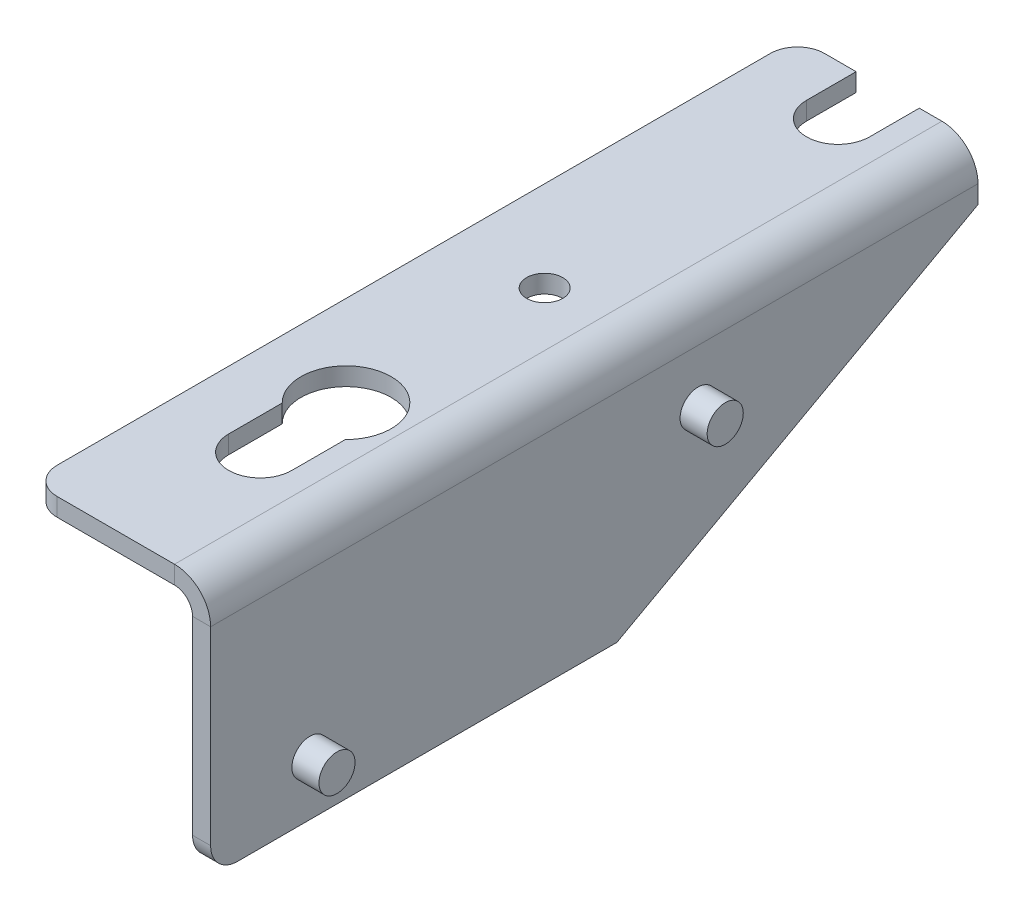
ISO-10303-21;
HEADER;
FILE_DESCRIPTION(('STEP AP214'),'2;1');
FILE_NAME('part.step','',(''),(''),'','','');
FILE_SCHEMA(('AUTOMOTIVE_DESIGN { 1 0 10303 214 1 1 1 1 }'));
ENDSEC;
DATA;
#1=APPLICATION_CONTEXT('core data for automotive mechanical design processes');
#2=APPLICATION_PROTOCOL_DEFINITION('international standard','automotive_design',2000,#1);
#3=PRODUCT_CONTEXT('',#1,'mechanical');
#4=PRODUCT('Part','Part','',(#3));
#5=PRODUCT_RELATED_PRODUCT_CATEGORY('part','',(#4));
#6=PRODUCT_DEFINITION_FORMATION('','',#4);
#7=PRODUCT_DEFINITION_CONTEXT('part definition',#1,'design');
#8=PRODUCT_DEFINITION('design','',#6,#7);
#9=PRODUCT_DEFINITION_SHAPE('','',#8);
#10=(LENGTH_UNIT() NAMED_UNIT(*) SI_UNIT(.MILLI.,.METRE.));
#11=(NAMED_UNIT(*) PLANE_ANGLE_UNIT() SI_UNIT($,.RADIAN.));
#12=(NAMED_UNIT(*) SI_UNIT($,.STERADIAN.) SOLID_ANGLE_UNIT());
#13=UNCERTAINTY_MEASURE_WITH_UNIT(LENGTH_MEASURE(1.E-05),#10,'distance_accuracy_value','');
#14=(GEOMETRIC_REPRESENTATION_CONTEXT(3) GLOBAL_UNCERTAINTY_ASSIGNED_CONTEXT((#13)) GLOBAL_UNIT_ASSIGNED_CONTEXT((#10,
#11,#12)) REPRESENTATION_CONTEXT('',''));
#15=CARTESIAN_POINT('',(0.,0.,0.));
#16=DIRECTION('',(0.,0.,1.));
#17=DIRECTION('',(1.,0.,0.));
#18=AXIS2_PLACEMENT_3D('',#15,#16,#17);
#19=CARTESIAN_POINT('',(0.,0.,85.0000000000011));
#20=DIRECTION('',(-1.,0.,0.));
#21=DIRECTION('',(0.,0.,1.));
#22=AXIS2_PLACEMENT_3D('',#19,#20,#21);
#23=PLANE('',#22);
#24=CARTESIAN_POINT('',(-1.55431223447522E-12,6.00000000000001,74.0000000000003));
#25=DIRECTION('',(-1.,0.,0.));
#26=DIRECTION('',(0.,0.,1.));
#27=AXIS2_PLACEMENT_3D('',#24,#25,#26);
#28=CIRCLE('',#27,2.);
#29=CARTESIAN_POINT('',(-1.55431223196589E-12,6.00000000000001,76.0000000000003));
#30=VERTEX_POINT('',#29);
#31=EDGE_CURVE('E56',#30,#30,#28,.F.);
#32=ORIENTED_EDGE('',*,*,#31,.F.);
#33=EDGE_LOOP('',(#32));
#34=FACE_BOUND('',#33,.T.);
#35=DIRECTION('',(0.,1.,0.));
#36=VECTOR('',#35,1.);
#37=CARTESIAN_POINT('',(0.,0.,85.0000000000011));
#38=LINE('',#37,#36);
#39=CARTESIAN_POINT('',(-1.55431223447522E-12,3.,84.9999999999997));
#40=VERTEX_POINT('',#39);
#41=CARTESIAN_POINT('',(0.,24.,84.9999999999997));
#42=VERTEX_POINT('',#41);
#43=EDGE_CURVE('E299',#40,#42,#38,.T.);
#44=ORIENTED_EDGE('',*,*,#43,.F.);
#45=CARTESIAN_POINT('',(-1.55431223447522E-12,3.00000000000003,81.9999999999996));
#46=DIRECTION('',(-1.,0.,0.));
#47=DIRECTION('',(0.,0.,1.));
#48=AXIS2_PLACEMENT_3D('',#45,#46,#47);
#49=CIRCLE('',#48,3.);
#50=CARTESIAN_POINT('',(0.,0.,82.0000000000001));
#51=VERTEX_POINT('',#50);
#52=EDGE_CURVE('E357',#40,#51,#49,.F.);
#53=ORIENTED_EDGE('',*,*,#52,.T.);
#54=DIRECTION('',(0.,0.,-1.));
#55=VECTOR('',#54,1.);
#56=CARTESIAN_POINT('',(0.,0.,85.0000000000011));
#57=LINE('',#56,#55);
#58=CARTESIAN_POINT('',(0.,0.,39.9999999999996));
#59=VERTEX_POINT('',#58);
#60=EDGE_CURVE('E310',#51,#59,#57,.T.);
#61=ORIENTED_EDGE('',*,*,#60,.T.);
#62=DIRECTION('',(0.,-0.481918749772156,0.876215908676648));
#63=VECTOR('',#62,1.);
#64=CARTESIAN_POINT('',(-1.55431223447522E-12,22.,-4.44089209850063E-13));
#65=LINE('',#64,#63);
#66=CARTESIAN_POINT('',(-1.55431223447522E-12,22.,-4.44089209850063E-13));
#67=VERTEX_POINT('',#66);
#68=EDGE_CURVE('E262',#67,#59,#65,.T.);
#69=ORIENTED_EDGE('',*,*,#68,.F.);
#70=DIRECTION('',(0.,1.,0.));
#71=VECTOR('',#70,1.);
#72=CARTESIAN_POINT('',(0.,0.,0.));
#73=LINE('',#72,#71);
#74=CARTESIAN_POINT('',(-1.55431223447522E-12,24.,0.));
#75=VERTEX_POINT('',#74);
#76=EDGE_CURVE('E283',#67,#75,#73,.T.);
#77=ORIENTED_EDGE('',*,*,#76,.T.);
#78=DIRECTION('',(0.,0.,-1.));
#79=VECTOR('',#78,1.);
#80=CARTESIAN_POINT('',(0.,24.,84.9999999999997));
#81=LINE('',#80,#79);
#82=EDGE_CURVE('E307',#42,#75,#81,.T.);
#83=ORIENTED_EDGE('',*,*,#82,.F.);
#84=EDGE_LOOP('',(#44,#53,#61,#69,#77,#83));
#85=FACE_BOUND('',#84,.T.);
#86=CARTESIAN_POINT('',(-1.55431223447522E-12,18.,30.9999999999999));
#87=DIRECTION('',(-1.,0.,0.));
#88=DIRECTION('',(0.,0.,1.));
#89=AXIS2_PLACEMENT_3D('',#86,#87,#88);
#90=CIRCLE('',#89,2.);
#91=CARTESIAN_POINT('',(-1.55431223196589E-12,18.,32.9999999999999));
#92=VERTEX_POINT('',#91);
#93=EDGE_CURVE('E11',#92,#92,#90,.F.);
#94=ORIENTED_EDGE('',*,*,#93,.F.);
#95=EDGE_LOOP('',(#94));
#96=FACE_BOUND('',#95,.T.);
#97=ADVANCED_FACE('F48',(#34,#85,#96),#23,.F.);
#98=CARTESIAN_POINT('',(-2.00000000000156,24.,0.));
#99=DIRECTION('',(0.,0.,-1.));
#100=DIRECTION('',(-1.,0.,0.));
#101=AXIS2_PLACEMENT_3D('',#98,#99,#100);
#102=PLANE('',#101);
#103=DIRECTION('',(0.,1.,0.));
#104=VECTOR('',#103,1.);
#105=CARTESIAN_POINT('',(-6.49999999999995,-0.00100000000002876,0.));
#106=LINE('',#105,#104);
#107=CARTESIAN_POINT('',(-6.5000000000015,26.,-1.55431223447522E-12));
#108=VERTEX_POINT('',#107);
#109=CARTESIAN_POINT('',(-6.5000000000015,28.,8.88178419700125E-13));
#110=VERTEX_POINT('',#109);
#111=EDGE_CURVE('E242',#108,#110,#106,.T.);
#112=ORIENTED_EDGE('',*,*,#111,.T.);
#113=DIRECTION('',(-1.,0.,0.));
#114=VECTOR('',#113,1.);
#115=CARTESIAN_POINT('',(-1.55431223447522E-12,28.,8.88178419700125E-13));
#116=LINE('',#115,#114);
#117=CARTESIAN_POINT('',(-4.00000000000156,28.,8.88178419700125E-13));
#118=VERTEX_POINT('',#117);
#119=EDGE_CURVE('E271',#118,#110,#116,.T.);
#120=ORIENTED_EDGE('',*,*,#119,.F.);
#121=DIRECTION('',(0.,-1.,0.));
#122=VECTOR('',#121,1.);
#123=CARTESIAN_POINT('',(-4.00000000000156,28.,8.88178419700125E-13));
#124=LINE('',#123,#122);
#125=CARTESIAN_POINT('',(-4.00000000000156,26.,-1.55431223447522E-12));
#126=VERTEX_POINT('',#125);
#127=EDGE_CURVE('E329',#118,#126,#124,.T.);
#128=ORIENTED_EDGE('',*,*,#127,.T.);
#129=DIRECTION('',(-1.,0.,0.));
#130=VECTOR('',#129,1.);
#131=CARTESIAN_POINT('',(-1.55431223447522E-12,26.,-1.55431223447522E-12));
#132=LINE('',#131,#130);
#133=EDGE_CURVE('E275',#126,#108,#132,.T.);
#134=ORIENTED_EDGE('',*,*,#133,.T.);
#135=EDGE_LOOP('',(#112,#120,#128,#134));
#136=FACE_BOUND('',#135,.T.);
#137=ADVANCED_FACE('F367',(#136),#102,.T.);
#138=CARTESIAN_POINT('',(-2.,0.,85.0000000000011));
#139=DIRECTION('',(-1.,0.,0.));
#140=DIRECTION('',(0.,0.,1.));
#141=AXIS2_PLACEMENT_3D('',#138,#139,#140);
#142=PLANE('',#141);
#143=DIRECTION('',(0.,0.,-1.));
#144=VECTOR('',#143,1.);
#145=CARTESIAN_POINT('',(-2.,0.,85.0000000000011));
#146=LINE('',#145,#144);
#147=CARTESIAN_POINT('',(-2.,0.,82.0000000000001));
#148=VERTEX_POINT('',#147);
#149=CARTESIAN_POINT('',(-2.,0.,39.9999999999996));
#150=VERTEX_POINT('',#149);
#151=EDGE_CURVE('E312',#148,#150,#146,.T.);
#152=ORIENTED_EDGE('',*,*,#151,.F.);
#153=CARTESIAN_POINT('',(-2.00000000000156,3.00000000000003,81.9999999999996));
#154=DIRECTION('',(-1.,0.,0.));
#155=DIRECTION('',(0.,0.,1.));
#156=AXIS2_PLACEMENT_3D('',#153,#154,#155);
#157=CIRCLE('',#156,3.);
#158=CARTESIAN_POINT('',(-2.00000000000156,3.,84.9999999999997));
#159=VERTEX_POINT('',#158);
#160=EDGE_CURVE('E71',#148,#159,#157,.T.);
#161=ORIENTED_EDGE('',*,*,#160,.T.);
#162=DIRECTION('',(0.,1.,0.));
#163=VECTOR('',#162,1.);
#164=CARTESIAN_POINT('',(-2.,0.,85.0000000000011));
#165=LINE('',#164,#163);
#166=CARTESIAN_POINT('',(-2.,24.,84.9999999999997));
#167=VERTEX_POINT('',#166);
#168=EDGE_CURVE('E297',#159,#167,#165,.T.);
#169=ORIENTED_EDGE('',*,*,#168,.T.);
#170=DIRECTION('',(0.,0.,-1.));
#171=VECTOR('',#170,1.);
#172=CARTESIAN_POINT('',(-2.,24.,84.9999999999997));
#173=LINE('',#172,#171);
#174=CARTESIAN_POINT('',(-2.00000000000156,24.,0.));
#175=VERTEX_POINT('',#174);
#176=EDGE_CURVE('E314',#167,#175,#173,.T.);
#177=ORIENTED_EDGE('',*,*,#176,.T.);
#178=DIRECTION('',(0.,1.,0.));
#179=VECTOR('',#178,1.);
#180=CARTESIAN_POINT('',(-2.,0.,0.));
#181=LINE('',#180,#179);
#182=CARTESIAN_POINT('',(-2.00000000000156,22.,-4.44089209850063E-13));
#183=VERTEX_POINT('',#182);
#184=EDGE_CURVE('E281',#183,#175,#181,.T.);
#185=ORIENTED_EDGE('',*,*,#184,.F.);
#186=DIRECTION('',(0.,-0.481918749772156,0.876215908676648));
#187=VECTOR('',#186,1.);
#188=CARTESIAN_POINT('',(-2.00000000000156,22.,-4.44089209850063E-13));
#189=LINE('',#188,#187);
#190=EDGE_CURVE('E257',#183,#150,#189,.T.);
#191=ORIENTED_EDGE('',*,*,#190,.T.);
#192=EDGE_LOOP('',(#152,#161,#169,#177,#185,#191));
#193=FACE_BOUND('',#192,.T.);
#194=ADVANCED_FACE('F453',(#193),#142,.T.);
#195=CARTESIAN_POINT('',(0.,0.,85.0000000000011));
#196=DIRECTION('',(0.,-1.,0.));
#197=DIRECTION('',(0.,0.,-1.));
#198=AXIS2_PLACEMENT_3D('',#195,#196,#197);
#199=PLANE('',#198);
#200=ORIENTED_EDGE('',*,*,#60,.F.);
#201=DIRECTION('',(-1.,0.,0.));
#202=VECTOR('',#201,1.);
#203=CARTESIAN_POINT('',(0.,0.,82.0000000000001));
#204=LINE('',#203,#202);
#205=EDGE_CURVE('E352',#51,#148,#204,.T.);
#206=ORIENTED_EDGE('',*,*,#205,.T.);
#207=ORIENTED_EDGE('',*,*,#151,.T.);
#208=DIRECTION('',(-1.,0.,0.));
#209=VECTOR('',#208,1.);
#210=CARTESIAN_POINT('',(-2.,0.,39.9999999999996));
#211=LINE('',#210,#209);
#212=EDGE_CURVE('E265',#150,#59,#211,.F.);
#213=ORIENTED_EDGE('',*,*,#212,.T.);
#214=EDGE_LOOP('',(#200,#206,#207,#213));
#215=FACE_BOUND('',#214,.T.);
#216=ADVANCED_FACE('F441',(#215),#199,.T.);
#217=CARTESIAN_POINT('',(-4.00000000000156,24.,0.));
#218=DIRECTION('',(0.,0.,1.));
#219=DIRECTION('',(1.,0.,0.));
#220=AXIS2_PLACEMENT_3D('',#217,#218,#219);
#221=PLANE('',#220);
#222=DIRECTION('',(-1.,0.,0.));
#223=VECTOR('',#222,1.);
#224=CARTESIAN_POINT('',(-2.00000000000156,22.,-4.44089209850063E-13));
#225=LINE('',#224,#223);
#226=EDGE_CURVE('E266',#183,#67,#225,.F.);
#227=ORIENTED_EDGE('',*,*,#226,.F.);
#228=ORIENTED_EDGE('',*,*,#184,.T.);
#229=DIRECTION('',(1.,0.,0.));
#230=VECTOR('',#229,1.);
#231=CARTESIAN_POINT('',(-2.00000000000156,24.,0.));
#232=LINE('',#231,#230);
#233=EDGE_CURVE('E326',#175,#75,#232,.T.);
#234=ORIENTED_EDGE('',*,*,#233,.T.);
#235=ORIENTED_EDGE('',*,*,#76,.F.);
#236=EDGE_LOOP('',(#227,#228,#234,#235));
#237=FACE_BOUND('',#236,.T.);
#238=ADVANCED_FACE('F438',(#237),#221,.F.);
#239=CARTESIAN_POINT('',(0.,24.,84.9999999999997));
#240=DIRECTION('',(0.,0.,1.));
#241=DIRECTION('',(1.,0.,0.));
#242=AXIS2_PLACEMENT_3D('',#239,#240,#241);
#243=PLANE('',#242);
#244=DIRECTION('',(-1.,0.,0.));
#245=VECTOR('',#244,1.);
#246=CARTESIAN_POINT('',(0.,24.,84.9999999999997));
#247=LINE('',#246,#245);
#248=EDGE_CURVE('E333',#42,#167,#247,.T.);
#249=ORIENTED_EDGE('',*,*,#248,.F.);
#250=CARTESIAN_POINT('',(-4.,24.,84.9999999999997));
#251=DIRECTION('',(0.,0.,-1.));
#252=DIRECTION('',(-1.,0.,0.));
#253=AXIS2_PLACEMENT_3D('',#250,#251,#252);
#254=CIRCLE('',#253,4.);
#255=CARTESIAN_POINT('',(-4.,28.0000000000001,84.9999999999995));
#256=VERTEX_POINT('',#255);
#257=EDGE_CURVE('E301',#42,#256,#254,.F.);
#258=ORIENTED_EDGE('',*,*,#257,.T.);
#259=DIRECTION('',(0.,1.,0.));
#260=VECTOR('',#259,1.);
#261=CARTESIAN_POINT('',(-4.,26.,85.));
#262=LINE('',#261,#260);
#263=CARTESIAN_POINT('',(-4.,26.,85.));
#264=VERTEX_POINT('',#263);
#265=EDGE_CURVE('E331',#264,#256,#262,.T.);
#266=ORIENTED_EDGE('',*,*,#265,.F.);
#267=CARTESIAN_POINT('',(-4.,24.,84.9999999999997));
#268=DIRECTION('',(0.,0.,1.));
#269=DIRECTION('',(1.,0.,0.));
#270=AXIS2_PLACEMENT_3D('',#267,#268,#269);
#271=CIRCLE('',#270,2.);
#272=EDGE_CURVE('E294',#167,#264,#271,.T.);
#273=ORIENTED_EDGE('',*,*,#272,.F.);
#274=EDGE_LOOP('',(#249,#258,#266,#273));
#275=FACE_BOUND('',#274,.T.);
#276=ADVANCED_FACE('F50',(#275),#243,.T.);
#277=CARTESIAN_POINT('',(-4.,26.,85.));
#278=DIRECTION('',(0.,0.,1.));
#279=DIRECTION('',(1.,0.,0.));
#280=AXIS2_PLACEMENT_3D('',#277,#278,#279);
#281=PLANE('',#280);
#282=ORIENTED_EDGE('',*,*,#168,.F.);
#283=DIRECTION('',(-1.,0.,0.));
#284=VECTOR('',#283,1.);
#285=CARTESIAN_POINT('',(-4.00000000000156,3.,84.9999999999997));
#286=LINE('',#285,#284);
#287=EDGE_CURVE('E63',#159,#40,#286,.F.);
#288=ORIENTED_EDGE('',*,*,#287,.T.);
#289=ORIENTED_EDGE('',*,*,#43,.T.);
#290=ORIENTED_EDGE('',*,*,#248,.T.);
#291=EDGE_LOOP('',(#282,#288,#289,#290));
#292=FACE_BOUND('',#291,.T.);
#293=ADVANCED_FACE('F476',(#292),#281,.T.);
#294=CARTESIAN_POINT('',(-4.00000000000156,28.,8.88178419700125E-13));
#295=DIRECTION('',(0.,0.,-1.));
#296=DIRECTION('',(-1.,0.,0.));
#297=AXIS2_PLACEMENT_3D('',#294,#295,#296);
#298=PLANE('',#297);
#299=ORIENTED_EDGE('',*,*,#127,.F.);
#300=CARTESIAN_POINT('',(-4.00000000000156,24.,0.));
#301=DIRECTION('',(0.,0.,-1.));
#302=DIRECTION('',(-1.,0.,0.));
#303=AXIS2_PLACEMENT_3D('',#300,#301,#302);
#304=CIRCLE('',#303,4.);
#305=EDGE_CURVE('E285',#75,#118,#304,.F.);
#306=ORIENTED_EDGE('',*,*,#305,.F.);
#307=ORIENTED_EDGE('',*,*,#233,.F.);
#308=CARTESIAN_POINT('',(-4.00000000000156,24.,0.));
#309=DIRECTION('',(0.,0.,1.));
#310=DIRECTION('',(1.,0.,0.));
#311=AXIS2_PLACEMENT_3D('',#308,#309,#310);
#312=CIRCLE('',#311,2.);
#313=EDGE_CURVE('E278',#175,#126,#312,.T.);
#314=ORIENTED_EDGE('',*,*,#313,.T.);
#315=EDGE_LOOP('',(#299,#306,#307,#314));
#316=FACE_BOUND('',#315,.T.);
#317=ADVANCED_FACE('F473',(#316),#298,.T.);
#318=CARTESIAN_POINT('',(-13.5000000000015,26.,0.));
#319=VERTEX_POINT('',#318);
#320=CARTESIAN_POINT('',(-17.0000000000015,26.,0.));
#321=VERTEX_POINT('',#320);
#322=EDGE_CURVE('E274',#319,#321,#132,.T.);
#323=ORIENTED_EDGE('',*,*,#322,.T.);
#324=DIRECTION('',(0.,1.,0.));
#325=VECTOR('',#324,1.);
#326=CARTESIAN_POINT('',(-17.0000000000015,24.,0.));
#327=LINE('',#326,#325);
#328=CARTESIAN_POINT('',(-17.0000000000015,28.,8.88178419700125E-13));
#329=VERTEX_POINT('',#328);
#330=EDGE_CURVE('E336',#321,#329,#327,.T.);
#331=ORIENTED_EDGE('',*,*,#330,.T.);
#332=CARTESIAN_POINT('',(-13.5000000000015,28.,8.88178419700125E-13));
#333=VERTEX_POINT('',#332);
#334=EDGE_CURVE('E268',#333,#329,#116,.T.);
#335=ORIENTED_EDGE('',*,*,#334,.F.);
#336=DIRECTION('',(0.,1.,0.));
#337=VECTOR('',#336,1.);
#338=CARTESIAN_POINT('',(-13.5,-0.00100000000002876,0.));
#339=LINE('',#338,#337);
#340=EDGE_CURVE('E241',#319,#333,#339,.T.);
#341=ORIENTED_EDGE('',*,*,#340,.F.);
#342=EDGE_LOOP('',(#323,#331,#335,#341));
#343=FACE_BOUND('',#342,.T.);
#344=ADVANCED_FACE('F469',(#343),#102,.T.);
#345=CARTESIAN_POINT('',(0.,28.0000000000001,84.9999999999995));
#346=DIRECTION('',(0.,-1.,0.));
#347=DIRECTION('',(1.,0.,0.));
#348=AXIS2_PLACEMENT_3D('',#345,#346,#347);
#349=PLANE('',#348);
#350=DIRECTION('',(0.,0.,-1.));
#351=VECTOR('',#350,1.);
#352=CARTESIAN_POINT('',(-6.50000000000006,28.,69.5000000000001));
#353=LINE('',#352,#351);
#354=CARTESIAN_POINT('',(-6.50000000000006,28.,69.5000000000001));
#355=VERTEX_POINT('',#354);
#356=CARTESIAN_POINT('',(-6.50000000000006,27.9999999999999,63.5707142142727));
#357=VERTEX_POINT('',#356);
#358=EDGE_CURVE('E212',#355,#357,#353,.T.);
#359=ORIENTED_EDGE('',*,*,#358,.F.);
#360=CARTESIAN_POINT('',(-10.,28.,69.4999999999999));
#361=DIRECTION('',(0.,1.,0.));
#362=DIRECTION('',(-1.,0.,0.));
#363=AXIS2_PLACEMENT_3D('',#360,#361,#362);
#364=CIRCLE('',#363,3.5);
#365=CARTESIAN_POINT('',(-13.5000000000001,28.,69.5000000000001));
#366=VERTEX_POINT('',#365);
#367=EDGE_CURVE('E204',#366,#355,#364,.T.);
#368=ORIENTED_EDGE('',*,*,#367,.F.);
#369=DIRECTION('',(0.,0.,1.));
#370=VECTOR('',#369,1.);
#371=CARTESIAN_POINT('',(-13.5000000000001,28.,69.5000000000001));
#372=LINE('',#371,#370);
#373=CARTESIAN_POINT('',(-13.5000000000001,28.,63.5707142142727));
#374=VERTEX_POINT('',#373);
#375=EDGE_CURVE('E205',#374,#366,#372,.T.);
#376=ORIENTED_EDGE('',*,*,#375,.F.);
#377=CARTESIAN_POINT('',(-10.,28.,60.0000000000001));
#378=DIRECTION('',(0.,1.,0.));
#379=DIRECTION('',(-1.,0.,0.));
#380=AXIS2_PLACEMENT_3D('',#377,#378,#379);
#381=CIRCLE('',#380,5.00000000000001);
#382=EDGE_CURVE('E219',#357,#374,#381,.T.);
#383=ORIENTED_EDGE('',*,*,#382,.F.);
#384=EDGE_LOOP('',(#359,#368,#376,#383));
#385=FACE_BOUND('',#384,.T.);
#386=CARTESIAN_POINT('',(-10.,27.9999999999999,38.0000000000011));
#387=DIRECTION('',(0.,1.,0.));
#388=DIRECTION('',(-1.,0.,0.));
#389=AXIS2_PLACEMENT_3D('',#386,#387,#388);
#390=CIRCLE('',#389,2.);
#391=CARTESIAN_POINT('',(-12.,27.9999999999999,38.0000000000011));
#392=VERTEX_POINT('',#391);
#393=EDGE_CURVE('E254',#392,#392,#390,.T.);
#394=ORIENTED_EDGE('',*,*,#393,.F.);
#395=EDGE_LOOP('',(#394));
#396=FACE_BOUND('',#395,.T.);
#397=ORIENTED_EDGE('',*,*,#334,.T.);
#398=CARTESIAN_POINT('',(-17.0000000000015,28.,3.00000000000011));
#399=DIRECTION('',(0.,-1.,0.));
#400=DIRECTION('',(1.,0.,0.));
#401=AXIS2_PLACEMENT_3D('',#398,#399,#400);
#402=CIRCLE('',#401,3.);
#403=CARTESIAN_POINT('',(-20.0000000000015,27.9999999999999,3.00000000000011));
#404=VERTEX_POINT('',#403);
#405=EDGE_CURVE('E341',#329,#404,#402,.F.);
#406=ORIENTED_EDGE('',*,*,#405,.T.);
#407=DIRECTION('',(0.,0.,-1.));
#408=VECTOR('',#407,1.);
#409=CARTESIAN_POINT('',(-20.,28.,84.9999999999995));
#410=LINE('',#409,#408);
#411=CARTESIAN_POINT('',(-20.,28.,82.0000000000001));
#412=VERTEX_POINT('',#411);
#413=EDGE_CURVE('E323',#412,#404,#410,.T.);
#414=ORIENTED_EDGE('',*,*,#413,.F.);
#415=CARTESIAN_POINT('',(-17.,28.,82.0000000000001));
#416=DIRECTION('',(0.,-1.,0.));
#417=DIRECTION('',(1.,0.,0.));
#418=AXIS2_PLACEMENT_3D('',#415,#416,#417);
#419=CIRCLE('',#418,3.);
#420=CARTESIAN_POINT('',(-17.,28.0000000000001,84.9999999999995));
#421=VERTEX_POINT('',#420);
#422=EDGE_CURVE('E339',#412,#421,#419,.F.);
#423=ORIENTED_EDGE('',*,*,#422,.T.);
#424=DIRECTION('',(-1.,0.,0.));
#425=VECTOR('',#424,1.);
#426=CARTESIAN_POINT('',(0.,28.0000000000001,84.9999999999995));
#427=LINE('',#426,#425);
#428=EDGE_CURVE('E288',#256,#421,#427,.T.);
#429=ORIENTED_EDGE('',*,*,#428,.F.);
#430=DIRECTION('',(0.,0.,-1.));
#431=VECTOR('',#430,1.);
#432=CARTESIAN_POINT('',(-4.,28.0000000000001,84.9999999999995));
#433=LINE('',#432,#431);
#434=EDGE_CURVE('E304',#256,#118,#433,.T.);
#435=ORIENTED_EDGE('',*,*,#434,.T.);
#436=ORIENTED_EDGE('',*,*,#119,.T.);
#437=DIRECTION('',(0.,0.,-1.));
#438=VECTOR('',#437,1.);
#439=CARTESIAN_POINT('',(-6.5000000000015,27.9999999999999,5.50000000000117));
#440=LINE('',#439,#438);
#441=CARTESIAN_POINT('',(-6.5000000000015,27.9999999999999,5.50000000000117));
#442=VERTEX_POINT('',#441);
#443=EDGE_CURVE('E239',#442,#110,#440,.T.);
#444=ORIENTED_EDGE('',*,*,#443,.F.);
#445=CARTESIAN_POINT('',(-10.0000000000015,28.,5.50000000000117));
#446=DIRECTION('',(0.,1.,0.));
#447=DIRECTION('',(-1.,0.,0.));
#448=AXIS2_PLACEMENT_3D('',#445,#446,#447);
#449=CIRCLE('',#448,3.5);
#450=CARTESIAN_POINT('',(-13.5000000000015,28.,5.50000000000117));
#451=VERTEX_POINT('',#450);
#452=EDGE_CURVE('E236',#451,#442,#449,.T.);
#453=ORIENTED_EDGE('',*,*,#452,.F.);
#454=DIRECTION('',(0.,0.,1.));
#455=VECTOR('',#454,1.);
#456=CARTESIAN_POINT('',(-13.5000000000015,28.,5.50000000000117));
#457=LINE('',#456,#455);
#458=EDGE_CURVE('E233',#333,#451,#457,.T.);
#459=ORIENTED_EDGE('',*,*,#458,.F.);
#460=EDGE_LOOP('',(#397,#406,#414,#423,#429,#435,#436,#444,#453,#459));
#461=FACE_BOUND('',#460,.T.);
#462=ADVANCED_FACE('F465',(#385,#396,#461),#349,.F.);
#463=CARTESIAN_POINT('',(-20.,26.,85.));
#464=DIRECTION('',(-1.,0.,0.));
#465=DIRECTION('',(0.,0.,1.));
#466=AXIS2_PLACEMENT_3D('',#463,#464,#465);
#467=PLANE('',#466);
#468=ORIENTED_EDGE('',*,*,#413,.T.);
#469=DIRECTION('',(0.,1.,0.));
#470=VECTOR('',#469,1.);
#471=CARTESIAN_POINT('',(-20.0000000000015,25.9999999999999,2.99999999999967));
#472=LINE('',#471,#470);
#473=CARTESIAN_POINT('',(-20.0000000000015,25.9999999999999,2.99999999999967));
#474=VERTEX_POINT('',#473);
#475=EDGE_CURVE('E346',#404,#474,#472,.F.);
#476=ORIENTED_EDGE('',*,*,#475,.T.);
#477=DIRECTION('',(0.,0.,-1.));
#478=VECTOR('',#477,1.);
#479=CARTESIAN_POINT('',(-20.,26.,85.));
#480=LINE('',#479,#478);
#481=CARTESIAN_POINT('',(-20.,25.9999999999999,82.0000000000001));
#482=VERTEX_POINT('',#481);
#483=EDGE_CURVE('E320',#482,#474,#480,.T.);
#484=ORIENTED_EDGE('',*,*,#483,.F.);
#485=DIRECTION('',(0.,1.,0.));
#486=VECTOR('',#485,1.);
#487=CARTESIAN_POINT('',(-20.,25.9999999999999,82.0000000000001));
#488=LINE('',#487,#486);
#489=EDGE_CURVE('E343',#482,#412,#488,.T.);
#490=ORIENTED_EDGE('',*,*,#489,.T.);
#491=EDGE_LOOP('',(#468,#476,#484,#490));
#492=FACE_BOUND('',#491,.T.);
#493=ADVANCED_FACE('F462',(#492),#467,.T.);
#494=CARTESIAN_POINT('',(0.,26.,85.));
#495=DIRECTION('',(0.,-1.,0.));
#496=DIRECTION('',(1.,0.,0.));
#497=AXIS2_PLACEMENT_3D('',#494,#495,#496);
#498=PLANE('',#497);
#499=CARTESIAN_POINT('',(-10.,26.,69.4999999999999));
#500=DIRECTION('',(0.,-1.,0.));
#501=DIRECTION('',(1.,0.,0.));
#502=AXIS2_PLACEMENT_3D('',#499,#500,#501);
#503=CIRCLE('',#502,3.5);
#504=CARTESIAN_POINT('',(-13.5000000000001,26.0000000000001,69.5000000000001));
#505=VERTEX_POINT('',#504);
#506=CARTESIAN_POINT('',(-6.50000000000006,26.,69.5000000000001));
#507=VERTEX_POINT('',#506);
#508=EDGE_CURVE('E201',#505,#507,#503,.F.);
#509=ORIENTED_EDGE('',*,*,#508,.T.);
#510=DIRECTION('',(0.,0.,-1.));
#511=VECTOR('',#510,1.);
#512=CARTESIAN_POINT('',(-6.50000000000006,26.,69.5000000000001));
#513=LINE('',#512,#511);
#514=CARTESIAN_POINT('',(-6.50000000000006,26.,63.570714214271));
#515=VERTEX_POINT('',#514);
#516=EDGE_CURVE('E185',#507,#515,#513,.T.);
#517=ORIENTED_EDGE('',*,*,#516,.T.);
#518=CARTESIAN_POINT('',(-10.,26.,59.9999999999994));
#519=DIRECTION('',(0.,-1.,0.));
#520=DIRECTION('',(1.,0.,0.));
#521=AXIS2_PLACEMENT_3D('',#518,#519,#520);
#522=CIRCLE('',#521,5.00000000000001);
#523=CARTESIAN_POINT('',(-13.5000000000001,26.,63.570714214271));
#524=VERTEX_POINT('',#523);
#525=EDGE_CURVE('E214',#515,#524,#522,.F.);
#526=ORIENTED_EDGE('',*,*,#525,.T.);
#527=DIRECTION('',(0.,0.,1.));
#528=VECTOR('',#527,1.);
#529=CARTESIAN_POINT('',(-13.5000000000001,26.0000000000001,69.5000000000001));
#530=LINE('',#529,#528);
#531=EDGE_CURVE('E210',#524,#505,#530,.T.);
#532=ORIENTED_EDGE('',*,*,#531,.T.);
#533=EDGE_LOOP('',(#509,#517,#526,#532));
#534=FACE_BOUND('',#533,.T.);
#535=ORIENTED_EDGE('',*,*,#483,.T.);
#536=CARTESIAN_POINT('',(-17.0000000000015,26.0000000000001,2.99999999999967));
#537=DIRECTION('',(0.,-1.,0.));
#538=DIRECTION('',(1.,0.,0.));
#539=AXIS2_PLACEMENT_3D('',#536,#537,#538);
#540=CIRCLE('',#539,3.);
#541=EDGE_CURVE('E350',#474,#321,#540,.T.);
#542=ORIENTED_EDGE('',*,*,#541,.T.);
#543=ORIENTED_EDGE('',*,*,#322,.F.);
#544=DIRECTION('',(0.,0.,1.));
#545=VECTOR('',#544,1.);
#546=CARTESIAN_POINT('',(-13.5000000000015,26.,5.50000000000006));
#547=LINE('',#546,#545);
#548=CARTESIAN_POINT('',(-13.5000000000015,26.,5.50000000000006));
#549=VERTEX_POINT('',#548);
#550=EDGE_CURVE('E245',#319,#549,#547,.T.);
#551=ORIENTED_EDGE('',*,*,#550,.T.);
#552=CARTESIAN_POINT('',(-10.0000000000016,26.,5.50000000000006));
#553=DIRECTION('',(0.,-1.,0.));
#554=DIRECTION('',(1.,0.,0.));
#555=AXIS2_PLACEMENT_3D('',#552,#553,#554);
#556=CIRCLE('',#555,3.5);
#557=CARTESIAN_POINT('',(-6.5000000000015,26.,5.50000000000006));
#558=VERTEX_POINT('',#557);
#559=EDGE_CURVE('E196',#549,#558,#556,.F.);
#560=ORIENTED_EDGE('',*,*,#559,.T.);
#561=DIRECTION('',(0.,0.,-1.));
#562=VECTOR('',#561,1.);
#563=CARTESIAN_POINT('',(-6.5000000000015,26.,5.50000000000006));
#564=LINE('',#563,#562);
#565=EDGE_CURVE('E230',#558,#108,#564,.T.);
#566=ORIENTED_EDGE('',*,*,#565,.T.);
#567=ORIENTED_EDGE('',*,*,#133,.F.);
#568=DIRECTION('',(0.,0.,-1.));
#569=VECTOR('',#568,1.);
#570=CARTESIAN_POINT('',(-4.,26.,85.));
#571=LINE('',#570,#569);
#572=EDGE_CURVE('E317',#264,#126,#571,.T.);
#573=ORIENTED_EDGE('',*,*,#572,.F.);
#574=DIRECTION('',(-1.,0.,0.));
#575=VECTOR('',#574,1.);
#576=CARTESIAN_POINT('',(0.,26.,85.));
#577=LINE('',#576,#575);
#578=CARTESIAN_POINT('',(-17.,26.,85.));
#579=VERTEX_POINT('',#578);
#580=EDGE_CURVE('E291',#264,#579,#577,.T.);
#581=ORIENTED_EDGE('',*,*,#580,.T.);
#582=CARTESIAN_POINT('',(-17.,26.,82.0000000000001));
#583=DIRECTION('',(0.,-1.,0.));
#584=DIRECTION('',(1.,0.,0.));
#585=AXIS2_PLACEMENT_3D('',#582,#583,#584);
#586=CIRCLE('',#585,3.);
#587=EDGE_CURVE('E348',#579,#482,#586,.T.);
#588=ORIENTED_EDGE('',*,*,#587,.T.);
#589=EDGE_LOOP('',(#535,#542,#543,#551,#560,#566,#567,#573,#581,#588));
#590=FACE_BOUND('',#589,.T.);
#591=CARTESIAN_POINT('',(-10.,26.,37.9999999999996));
#592=DIRECTION('',(0.,-1.,0.));
#593=DIRECTION('',(1.,0.,0.));
#594=AXIS2_PLACEMENT_3D('',#591,#592,#593);
#595=CIRCLE('',#594,2.);
#596=CARTESIAN_POINT('',(-8.00000000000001,26.,37.9999999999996));
#597=VERTEX_POINT('',#596);
#598=EDGE_CURVE('E253',#597,#597,#595,.F.);
#599=ORIENTED_EDGE('',*,*,#598,.T.);
#600=EDGE_LOOP('',(#599));
#601=FACE_BOUND('',#600,.T.);
#602=ADVANCED_FACE('F208',(#534,#590,#601),#498,.T.);
#603=CARTESIAN_POINT('',(-4.,24.,84.9999999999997));
#604=DIRECTION('',(0.,0.,-1.));
#605=DIRECTION('',(-1.,0.,0.));
#606=AXIS2_PLACEMENT_3D('',#603,#604,#605);
#607=CYLINDRICAL_SURFACE('',#606,2.);
#608=ORIENTED_EDGE('',*,*,#313,.F.);
#609=ORIENTED_EDGE('',*,*,#176,.F.);
#610=ORIENTED_EDGE('',*,*,#272,.T.);
#611=ORIENTED_EDGE('',*,*,#572,.T.);
#612=EDGE_LOOP('',(#608,#609,#610,#611));
#613=FACE_BOUND('',#612,.T.);
#614=ADVANCED_FACE('F448',(#613),#607,.F.);
#615=CARTESIAN_POINT('',(-4.,24.,84.9999999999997));
#616=DIRECTION('',(0.,0.,-1.));
#617=DIRECTION('',(-1.,0.,0.));
#618=AXIS2_PLACEMENT_3D('',#615,#616,#617);
#619=CYLINDRICAL_SURFACE('',#618,4.);
#620=ORIENTED_EDGE('',*,*,#305,.T.);
#621=ORIENTED_EDGE('',*,*,#434,.F.);
#622=ORIENTED_EDGE('',*,*,#257,.F.);
#623=ORIENTED_EDGE('',*,*,#82,.T.);
#624=EDGE_LOOP('',(#620,#621,#622,#623));
#625=FACE_BOUND('',#624,.T.);
#626=ADVANCED_FACE('F445',(#625),#619,.T.);
#627=CARTESIAN_POINT('',(-4.,24.,84.9999999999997));
#628=DIRECTION('',(0.,0.,1.));
#629=DIRECTION('',(1.,0.,0.));
#630=AXIS2_PLACEMENT_3D('',#627,#628,#629);
#631=PLANE('',#630);
#632=ORIENTED_EDGE('',*,*,#428,.T.);
#633=DIRECTION('',(0.,1.,0.));
#634=VECTOR('',#633,1.);
#635=CARTESIAN_POINT('',(-17.,24.,84.9999999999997));
#636=LINE('',#635,#634);
#637=EDGE_CURVE('E359',#421,#579,#636,.F.);
#638=ORIENTED_EDGE('',*,*,#637,.T.);
#639=ORIENTED_EDGE('',*,*,#580,.F.);
#640=ORIENTED_EDGE('',*,*,#265,.T.);
#641=EDGE_LOOP('',(#632,#638,#639,#640));
#642=FACE_BOUND('',#641,.T.);
#643=ADVANCED_FACE('F436',(#642),#631,.T.);
#644=CARTESIAN_POINT('',(-2.00000000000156,22.,-4.44089209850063E-13));
#645=DIRECTION('',(0.,-0.876215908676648,-0.481918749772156));
#646=DIRECTION('',(0.,-0.481918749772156,0.876215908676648));
#647=AXIS2_PLACEMENT_3D('',#644,#645,#646);
#648=PLANE('',#647);
#649=ORIENTED_EDGE('',*,*,#190,.F.);
#650=ORIENTED_EDGE('',*,*,#226,.T.);
#651=ORIENTED_EDGE('',*,*,#68,.T.);
#652=ORIENTED_EDGE('',*,*,#212,.F.);
#653=EDGE_LOOP('',(#649,#650,#651,#652));
#654=FACE_BOUND('',#653,.T.);
#655=ADVANCED_FACE('F432',(#654),#648,.T.);
#656=CARTESIAN_POINT('',(-10.,-0.00100000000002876,38.));
#657=DIRECTION('',(0.,1.,0.));
#658=DIRECTION('',(-1.,0.,0.));
#659=AXIS2_PLACEMENT_3D('',#656,#657,#658);
#660=CYLINDRICAL_SURFACE('',#659,2.);
#661=ORIENTED_EDGE('',*,*,#598,.F.);
#662=EDGE_LOOP('',(#661));
#663=FACE_BOUND('',#662,.T.);
#664=ORIENTED_EDGE('',*,*,#393,.T.);
#665=EDGE_LOOP('',(#664));
#666=FACE_BOUND('',#665,.T.);
#667=ADVANCED_FACE('F422',(#663,#666),#660,.F.);
#668=CARTESIAN_POINT('',(-6.49999999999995,-0.001000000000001,5.49999999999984));
#669=DIRECTION('',(1.,0.,0.));
#670=DIRECTION('',(0.,1.,0.));
#671=AXIS2_PLACEMENT_3D('',#668,#669,#670);
#672=PLANE('',#671);
#673=DIRECTION('',(0.,1.,0.));
#674=VECTOR('',#673,1.);
#675=CARTESIAN_POINT('',(-6.49999999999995,-0.001000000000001,5.49999999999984));
#676=LINE('',#675,#674);
#677=EDGE_CURVE('E246',#558,#442,#676,.T.);
#678=ORIENTED_EDGE('',*,*,#677,.T.);
#679=ORIENTED_EDGE('',*,*,#443,.T.);
#680=ORIENTED_EDGE('',*,*,#111,.F.);
#681=ORIENTED_EDGE('',*,*,#565,.F.);
#682=EDGE_LOOP('',(#678,#679,#680,#681));
#683=FACE_BOUND('',#682,.T.);
#684=ADVANCED_FACE('F418',(#683),#672,.F.);
#685=CARTESIAN_POINT('',(-10.,-0.00100000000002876,5.49999999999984));
#686=DIRECTION('',(0.,1.,0.));
#687=DIRECTION('',(-1.,0.,0.));
#688=AXIS2_PLACEMENT_3D('',#685,#686,#687);
#689=CYLINDRICAL_SURFACE('',#688,3.5);
#690=DIRECTION('',(0.,1.,0.));
#691=VECTOR('',#690,1.);
#692=CARTESIAN_POINT('',(-13.5,-0.001000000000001,5.49999999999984));
#693=LINE('',#692,#691);
#694=EDGE_CURVE('E248',#549,#451,#693,.T.);
#695=ORIENTED_EDGE('',*,*,#694,.T.);
#696=ORIENTED_EDGE('',*,*,#452,.T.);
#697=ORIENTED_EDGE('',*,*,#677,.F.);
#698=ORIENTED_EDGE('',*,*,#559,.F.);
#699=EDGE_LOOP('',(#695,#696,#697,#698));
#700=FACE_BOUND('',#699,.T.);
#701=ADVANCED_FACE('F421',(#700),#689,.F.);
#702=CARTESIAN_POINT('',(-13.5,-0.001000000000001,5.49999999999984));
#703=DIRECTION('',(-1.,0.,0.));
#704=DIRECTION('',(0.,0.,1.));
#705=AXIS2_PLACEMENT_3D('',#702,#703,#704);
#706=PLANE('',#705);
#707=ORIENTED_EDGE('',*,*,#340,.T.);
#708=ORIENTED_EDGE('',*,*,#458,.T.);
#709=ORIENTED_EDGE('',*,*,#694,.F.);
#710=ORIENTED_EDGE('',*,*,#550,.F.);
#711=EDGE_LOOP('',(#707,#708,#709,#710));
#712=FACE_BOUND('',#711,.T.);
#713=ADVANCED_FACE('F417',(#712),#706,.F.);
#714=CARTESIAN_POINT('',(-10.,-0.00100000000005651,69.4999999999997));
#715=DIRECTION('',(0.,1.,0.));
#716=DIRECTION('',(-1.,0.,0.));
#717=AXIS2_PLACEMENT_3D('',#714,#715,#716);
#718=CYLINDRICAL_SURFACE('',#717,3.5);
#719=DIRECTION('',(0.,1.,0.));
#720=VECTOR('',#719,1.);
#721=CARTESIAN_POINT('',(-13.5,-0.00100000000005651,69.4999999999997));
#722=LINE('',#721,#720);
#723=EDGE_CURVE('E197',#505,#366,#722,.T.);
#724=ORIENTED_EDGE('',*,*,#723,.T.);
#725=ORIENTED_EDGE('',*,*,#367,.T.);
#726=DIRECTION('',(0.,1.,0.));
#727=VECTOR('',#726,1.);
#728=CARTESIAN_POINT('',(-6.49999999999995,-0.00100000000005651,69.4999999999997));
#729=LINE('',#728,#727);
#730=EDGE_CURVE('E189',#507,#355,#729,.T.);
#731=ORIENTED_EDGE('',*,*,#730,.F.);
#732=ORIENTED_EDGE('',*,*,#508,.F.);
#733=EDGE_LOOP('',(#724,#725,#731,#732));
#734=FACE_BOUND('',#733,.T.);
#735=ADVANCED_FACE('F200',(#734),#718,.F.);
#736=CARTESIAN_POINT('',(-13.5,-0.00100000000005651,69.4999999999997));
#737=DIRECTION('',(-1.,0.,0.));
#738=DIRECTION('',(0.,-1.,0.));
#739=AXIS2_PLACEMENT_3D('',#736,#737,#738);
#740=PLANE('',#739);
#741=DIRECTION('',(0.,1.,0.));
#742=VECTOR('',#741,1.);
#743=CARTESIAN_POINT('',(-13.5,-0.00100000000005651,63.5707142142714));
#744=LINE('',#743,#742);
#745=EDGE_CURVE('E225',#524,#374,#744,.T.);
#746=ORIENTED_EDGE('',*,*,#745,.T.);
#747=ORIENTED_EDGE('',*,*,#375,.T.);
#748=ORIENTED_EDGE('',*,*,#723,.F.);
#749=ORIENTED_EDGE('',*,*,#531,.F.);
#750=EDGE_LOOP('',(#746,#747,#748,#749));
#751=FACE_BOUND('',#750,.T.);
#752=ADVANCED_FACE('F405',(#751),#740,.F.);
#753=CARTESIAN_POINT('',(-10.,-0.00100000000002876,59.9999999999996));
#754=DIRECTION('',(0.,1.,0.));
#755=DIRECTION('',(-1.,0.,0.));
#756=AXIS2_PLACEMENT_3D('',#753,#754,#755);
#757=CYLINDRICAL_SURFACE('',#756,5.00000000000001);
#758=DIRECTION('',(0.,1.,0.));
#759=VECTOR('',#758,1.);
#760=CARTESIAN_POINT('',(-6.49999999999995,-0.00100000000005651,63.5707142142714));
#761=LINE('',#760,#759);
#762=EDGE_CURVE('E191',#515,#357,#761,.T.);
#763=ORIENTED_EDGE('',*,*,#762,.T.);
#764=ORIENTED_EDGE('',*,*,#382,.T.);
#765=ORIENTED_EDGE('',*,*,#745,.F.);
#766=ORIENTED_EDGE('',*,*,#525,.F.);
#767=EDGE_LOOP('',(#763,#764,#765,#766));
#768=FACE_BOUND('',#767,.T.);
#769=ADVANCED_FACE('F408',(#768),#757,.F.);
#770=CARTESIAN_POINT('',(-6.49999999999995,-0.00100000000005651,69.4999999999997));
#771=DIRECTION('',(1.,0.,0.));
#772=DIRECTION('',(0.,1.,0.));
#773=AXIS2_PLACEMENT_3D('',#770,#771,#772);
#774=PLANE('',#773);
#775=ORIENTED_EDGE('',*,*,#730,.T.);
#776=ORIENTED_EDGE('',*,*,#358,.T.);
#777=ORIENTED_EDGE('',*,*,#762,.F.);
#778=ORIENTED_EDGE('',*,*,#516,.F.);
#779=EDGE_LOOP('',(#775,#776,#777,#778));
#780=FACE_BOUND('',#779,.T.);
#781=ADVANCED_FACE('F187',(#780),#774,.F.);
#782=CARTESIAN_POINT('',(-17.0000000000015,24.,3.000000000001));
#783=DIRECTION('',(0.,1.,0.));
#784=DIRECTION('',(0.,0.,1.));
#785=AXIS2_PLACEMENT_3D('',#782,#783,#784);
#786=CYLINDRICAL_SURFACE('',#785,3.);
#787=ORIENTED_EDGE('',*,*,#541,.F.);
#788=ORIENTED_EDGE('',*,*,#475,.F.);
#789=ORIENTED_EDGE('',*,*,#405,.F.);
#790=ORIENTED_EDGE('',*,*,#330,.F.);
#791=EDGE_LOOP('',(#787,#788,#789,#790));
#792=FACE_BOUND('',#791,.T.);
#793=ADVANCED_FACE('F400',(#792),#786,.T.);
#794=CARTESIAN_POINT('',(-1.55431223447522E-12,3.00000000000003,81.9999999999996));
#795=DIRECTION('',(-1.,0.,0.));
#796=DIRECTION('',(0.,0.,1.));
#797=AXIS2_PLACEMENT_3D('',#794,#795,#796);
#798=CYLINDRICAL_SURFACE('',#797,3.);
#799=ORIENTED_EDGE('',*,*,#52,.F.);
#800=ORIENTED_EDGE('',*,*,#287,.F.);
#801=ORIENTED_EDGE('',*,*,#160,.F.);
#802=ORIENTED_EDGE('',*,*,#205,.F.);
#803=EDGE_LOOP('',(#799,#800,#801,#802));
#804=FACE_BOUND('',#803,.T.);
#805=ADVANCED_FACE('F396',(#804),#798,.T.);
#806=CARTESIAN_POINT('',(-17.,26.,82.0000000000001));
#807=DIRECTION('',(0.,1.,0.));
#808=DIRECTION('',(0.,0.,1.));
#809=AXIS2_PLACEMENT_3D('',#806,#807,#808);
#810=CYLINDRICAL_SURFACE('',#809,3.);
#811=ORIENTED_EDGE('',*,*,#587,.F.);
#812=ORIENTED_EDGE('',*,*,#637,.F.);
#813=ORIENTED_EDGE('',*,*,#422,.F.);
#814=ORIENTED_EDGE('',*,*,#489,.F.);
#815=EDGE_LOOP('',(#811,#812,#813,#814));
#816=FACE_BOUND('',#815,.T.);
#817=ADVANCED_FACE('F392',(#816),#810,.T.);
#818=CARTESIAN_POINT('',(2.99999999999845,6.00000000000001,74.0000000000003));
#819=DIRECTION('',(-1.,0.,0.));
#820=DIRECTION('',(0.,0.,1.));
#821=AXIS2_PLACEMENT_3D('',#818,#819,#820);
#822=CYLINDRICAL_SURFACE('',#821,2.);
#823=CARTESIAN_POINT('',(2.99999999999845,6.00000000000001,74.0000000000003));
#824=DIRECTION('',(1.,0.,0.));
#825=DIRECTION('',(0.,0.,-1.));
#826=AXIS2_PLACEMENT_3D('',#823,#824,#825);
#827=CIRCLE('',#826,2.);
#828=CARTESIAN_POINT('',(2.99999999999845,6.00000000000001,72.0000000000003));
#829=VERTEX_POINT('',#828);
#830=EDGE_CURVE('E700',#829,#829,#827,.T.);
#831=ORIENTED_EDGE('',*,*,#830,.F.);
#832=EDGE_LOOP('',(#831));
#833=FACE_BOUND('',#832,.T.);
#834=ORIENTED_EDGE('',*,*,#31,.T.);
#835=EDGE_LOOP('',(#834));
#836=FACE_BOUND('',#835,.T.);
#837=ADVANCED_FACE('F363',(#833,#836),#822,.T.);
#838=CARTESIAN_POINT('',(2.99999999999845,6.00000000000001,74.0000000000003));
#839=DIRECTION('',(1.,0.,0.));
#840=DIRECTION('',(0.,0.,-1.));
#841=AXIS2_PLACEMENT_3D('',#838,#839,#840);
#842=PLANE('',#841);
#843=ORIENTED_EDGE('',*,*,#830,.T.);
#844=EDGE_LOOP('',(#843));
#845=FACE_BOUND('',#844,.T.);
#846=ADVANCED_FACE('F377',(#845),#842,.T.);
#847=CARTESIAN_POINT('',(2.99999999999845,18.,30.9999999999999));
#848=DIRECTION('',(-1.,0.,0.));
#849=DIRECTION('',(0.,0.,1.));
#850=AXIS2_PLACEMENT_3D('',#847,#848,#849);
#851=CYLINDRICAL_SURFACE('',#850,2.);
#852=CARTESIAN_POINT('',(2.99999999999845,18.,30.9999999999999));
#853=DIRECTION('',(1.,0.,0.));
#854=DIRECTION('',(0.,0.,-1.));
#855=AXIS2_PLACEMENT_3D('',#852,#853,#854);
#856=CIRCLE('',#855,2.);
#857=CARTESIAN_POINT('',(2.99999999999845,18.,28.9999999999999));
#858=VERTEX_POINT('',#857);
#859=EDGE_CURVE('E702',#858,#858,#856,.T.);
#860=ORIENTED_EDGE('',*,*,#859,.F.);
#861=EDGE_LOOP('',(#860));
#862=FACE_BOUND('',#861,.T.);
#863=ORIENTED_EDGE('',*,*,#93,.T.);
#864=EDGE_LOOP('',(#863));
#865=FACE_BOUND('',#864,.T.);
#866=ADVANCED_FACE('F374',(#862,#865),#851,.T.);
#867=CARTESIAN_POINT('',(2.99999999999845,18.,30.9999999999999));
#868=DIRECTION('',(1.,0.,0.));
#869=DIRECTION('',(0.,0.,-1.));
#870=AXIS2_PLACEMENT_3D('',#867,#868,#869);
#871=PLANE('',#870);
#872=ORIENTED_EDGE('',*,*,#859,.T.);
#873=EDGE_LOOP('',(#872));
#874=FACE_BOUND('',#873,.T.);
#875=ADVANCED_FACE('F376',(#874),#871,.T.);
#876=CLOSED_SHELL('',(#97,#137,#194,#216,#238,#276,#293,#317,#344,#462,#493,#602,#614,#626,#643,
#655,#667,#684,#701,#713,#735,#752,#769,#781,#793,#805,#817,#837,#846,#866,#875));
#877=MANIFOLD_SOLID_BREP('B2',#876);
#878=ADVANCED_BREP_SHAPE_REPRESENTATION('',(#18,#877),#14);
#879=SHAPE_DEFINITION_REPRESENTATION(#9,#878);
ENDSEC;
END-ISO-10303-21;
